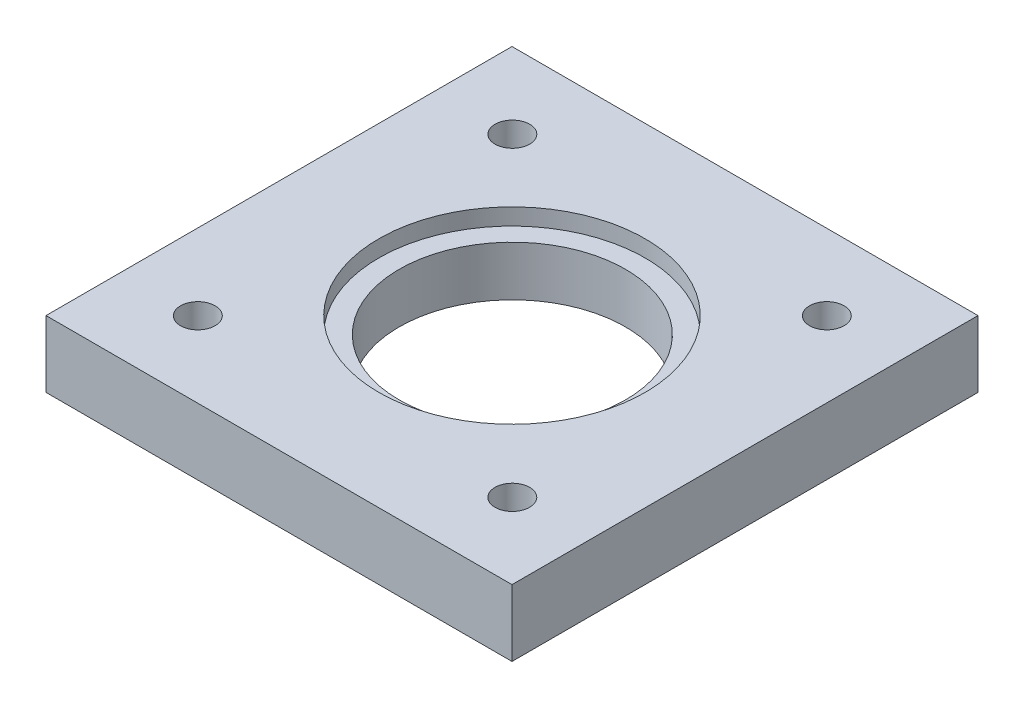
ISO-10303-21;
HEADER;
FILE_DESCRIPTION(('STEP AP214'),'2;1');
FILE_NAME('part.step','',(''),(''),'','','');
FILE_SCHEMA(('AUTOMOTIVE_DESIGN { 1 0 10303 214 1 1 1 1 }'));
ENDSEC;
DATA;
#1=APPLICATION_CONTEXT('core data for automotive mechanical design processes');
#2=APPLICATION_PROTOCOL_DEFINITION('international standard','automotive_design',2000,#1);
#3=PRODUCT_CONTEXT('',#1,'mechanical');
#4=PRODUCT('Part','Part','',(#3));
#5=PRODUCT_RELATED_PRODUCT_CATEGORY('part','',(#4));
#6=PRODUCT_DEFINITION_FORMATION('','',#4);
#7=PRODUCT_DEFINITION_CONTEXT('part definition',#1,'design');
#8=PRODUCT_DEFINITION('design','',#6,#7);
#9=PRODUCT_DEFINITION_SHAPE('','',#8);
#10=(LENGTH_UNIT() NAMED_UNIT(*) SI_UNIT(.MILLI.,.METRE.));
#11=(NAMED_UNIT(*) PLANE_ANGLE_UNIT() SI_UNIT($,.RADIAN.));
#12=(NAMED_UNIT(*) SI_UNIT($,.STERADIAN.) SOLID_ANGLE_UNIT());
#13=UNCERTAINTY_MEASURE_WITH_UNIT(LENGTH_MEASURE(1.E-05),#10,'distance_accuracy_value','');
#14=(GEOMETRIC_REPRESENTATION_CONTEXT(3) GLOBAL_UNCERTAINTY_ASSIGNED_CONTEXT((#13)) GLOBAL_UNIT_ASSIGNED_CONTEXT((#10,
#11,#12)) REPRESENTATION_CONTEXT('',''));
#15=CARTESIAN_POINT('',(0.,0.,0.));
#16=DIRECTION('',(0.,0.,1.));
#17=DIRECTION('',(1.,0.,0.));
#18=AXIS2_PLACEMENT_3D('',#15,#16,#17);
#19=CARTESIAN_POINT('',(-38.3070866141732,10.,-32.6574803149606));
#20=DIRECTION('',(1.,0.,0.));
#21=DIRECTION('',(0.,0.,-1.));
#22=AXIS2_PLACEMENT_3D('',#19,#20,#21);
#23=PLANE('',#22);
#24=DIRECTION('',(0.,0.,1.));
#25=VECTOR('',#24,1.);
#26=CARTESIAN_POINT('',(-38.3070866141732,0.,-32.6574803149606));
#27=LINE('',#26,#25);
#28=CARTESIAN_POINT('',(-38.3070866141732,0.,-32.6574803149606));
#29=VERTEX_POINT('',#28);
#30=CARTESIAN_POINT('',(-38.3070866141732,0.,37.3425196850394));
#31=VERTEX_POINT('',#30);
#32=EDGE_CURVE('E108',#29,#31,#27,.T.);
#33=ORIENTED_EDGE('',*,*,#32,.T.);
#34=DIRECTION('',(0.,-1.,0.));
#35=VECTOR('',#34,1.);
#36=CARTESIAN_POINT('',(-38.3070866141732,10.,37.3425196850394));
#37=LINE('',#36,#35);
#38=CARTESIAN_POINT('',(-38.3070866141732,10.,37.3425196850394));
#39=VERTEX_POINT('',#38);
#40=EDGE_CURVE('E11',#39,#31,#37,.T.);
#41=ORIENTED_EDGE('',*,*,#40,.F.);
#42=DIRECTION('',(0.,0.,1.));
#43=VECTOR('',#42,1.);
#44=CARTESIAN_POINT('',(-38.3070866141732,10.,-32.6574803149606));
#45=LINE('',#44,#43);
#46=CARTESIAN_POINT('',(-38.3070866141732,10.,-32.6574803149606));
#47=VERTEX_POINT('',#46);
#48=EDGE_CURVE('E96',#47,#39,#45,.T.);
#49=ORIENTED_EDGE('',*,*,#48,.F.);
#50=DIRECTION('',(0.,-1.,0.));
#51=VECTOR('',#50,1.);
#52=CARTESIAN_POINT('',(-38.3070866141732,10.,-32.6574803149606));
#53=LINE('',#52,#51);
#54=EDGE_CURVE('E104',#47,#29,#53,.T.);
#55=ORIENTED_EDGE('',*,*,#54,.T.);
#56=EDGE_LOOP('',(#33,#41,#49,#55));
#57=FACE_BOUND('',#56,.T.);
#58=ADVANCED_FACE('F45',(#57),#23,.F.);
#59=CARTESIAN_POINT('',(-38.3070866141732,10.,37.3425196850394));
#60=DIRECTION('',(0.,0.,-1.));
#61=DIRECTION('',(-1.,0.,0.));
#62=AXIS2_PLACEMENT_3D('',#59,#60,#61);
#63=PLANE('',#62);
#64=DIRECTION('',(1.,0.,0.));
#65=VECTOR('',#64,1.);
#66=CARTESIAN_POINT('',(-38.3070866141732,0.,37.3425196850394));
#67=LINE('',#66,#65);
#68=CARTESIAN_POINT('',(31.6929133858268,0.,37.3425196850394));
#69=VERTEX_POINT('',#68);
#70=EDGE_CURVE('E100',#31,#69,#67,.T.);
#71=ORIENTED_EDGE('',*,*,#70,.T.);
#72=DIRECTION('',(0.,-1.,0.));
#73=VECTOR('',#72,1.);
#74=CARTESIAN_POINT('',(31.6929133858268,10.,37.3425196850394));
#75=LINE('',#74,#73);
#76=CARTESIAN_POINT('',(31.6929133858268,10.,37.3425196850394));
#77=VERTEX_POINT('',#76);
#78=EDGE_CURVE('E53',#77,#69,#75,.T.);
#79=ORIENTED_EDGE('',*,*,#78,.F.);
#80=DIRECTION('',(1.,0.,0.));
#81=VECTOR('',#80,1.);
#82=CARTESIAN_POINT('',(-38.3070866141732,10.,37.3425196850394));
#83=LINE('',#82,#81);
#84=EDGE_CURVE('E91',#39,#77,#83,.T.);
#85=ORIENTED_EDGE('',*,*,#84,.F.);
#86=ORIENTED_EDGE('',*,*,#40,.T.);
#87=EDGE_LOOP('',(#71,#79,#85,#86));
#88=FACE_BOUND('',#87,.T.);
#89=ADVANCED_FACE('F99',(#88),#63,.F.);
#90=CARTESIAN_POINT('',(31.6929133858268,10.,-32.6574803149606));
#91=DIRECTION('',(-1.,0.,0.));
#92=DIRECTION('',(0.,0.,1.));
#93=AXIS2_PLACEMENT_3D('',#90,#91,#92);
#94=PLANE('',#93);
#95=DIRECTION('',(0.,0.,-1.));
#96=VECTOR('',#95,1.);
#97=CARTESIAN_POINT('',(31.6929133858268,0.,-32.6574803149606));
#98=LINE('',#97,#96);
#99=CARTESIAN_POINT('',(31.6929133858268,0.,-32.6574803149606));
#100=VERTEX_POINT('',#99);
#101=EDGE_CURVE('E78',#69,#100,#98,.T.);
#102=ORIENTED_EDGE('',*,*,#101,.T.);
#103=DIRECTION('',(0.,-1.,0.));
#104=VECTOR('',#103,1.);
#105=CARTESIAN_POINT('',(31.6929133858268,10.,-32.6574803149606));
#106=LINE('',#105,#104);
#107=CARTESIAN_POINT('',(31.6929133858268,10.,-32.6574803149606));
#108=VERTEX_POINT('',#107);
#109=EDGE_CURVE('E101',#108,#100,#106,.T.);
#110=ORIENTED_EDGE('',*,*,#109,.F.);
#111=DIRECTION('',(0.,0.,-1.));
#112=VECTOR('',#111,1.);
#113=CARTESIAN_POINT('',(31.6929133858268,10.,-32.6574803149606));
#114=LINE('',#113,#112);
#115=EDGE_CURVE('E94',#77,#108,#114,.T.);
#116=ORIENTED_EDGE('',*,*,#115,.F.);
#117=ORIENTED_EDGE('',*,*,#78,.T.);
#118=EDGE_LOOP('',(#102,#110,#116,#117));
#119=FACE_BOUND('',#118,.T.);
#120=ADVANCED_FACE('F102',(#119),#94,.F.);
#121=CARTESIAN_POINT('',(-38.3070866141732,10.,-32.6574803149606));
#122=DIRECTION('',(0.,0.,1.));
#123=DIRECTION('',(1.,0.,0.));
#124=AXIS2_PLACEMENT_3D('',#121,#122,#123);
#125=PLANE('',#124);
#126=DIRECTION('',(-1.,0.,0.));
#127=VECTOR('',#126,1.);
#128=CARTESIAN_POINT('',(-38.3070866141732,0.,-32.6574803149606));
#129=LINE('',#128,#127);
#130=EDGE_CURVE('E84',#100,#29,#129,.T.);
#131=ORIENTED_EDGE('',*,*,#130,.T.);
#132=ORIENTED_EDGE('',*,*,#54,.F.);
#133=DIRECTION('',(-1.,0.,0.));
#134=VECTOR('',#133,1.);
#135=CARTESIAN_POINT('',(-38.3070866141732,10.,-32.6574803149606));
#136=LINE('',#135,#134);
#137=EDGE_CURVE('E61',#108,#47,#136,.T.);
#138=ORIENTED_EDGE('',*,*,#137,.F.);
#139=ORIENTED_EDGE('',*,*,#109,.T.);
#140=EDGE_LOOP('',(#131,#132,#138,#139));
#141=FACE_BOUND('',#140,.T.);
#142=ADVANCED_FACE('F116',(#141),#125,.F.);
#143=CARTESIAN_POINT('',(0.,10.,0.));
#144=DIRECTION('',(0.,1.,0.));
#145=DIRECTION('',(0.,0.,1.));
#146=AXIS2_PLACEMENT_3D('',#143,#144,#145);
#147=PLANE('',#146);
#148=CARTESIAN_POINT('',(-3.30708651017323,10.,2.34251968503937));
#149=DIRECTION('',(0.,1.,0.));
#150=DIRECTION('',(0.,0.,1.));
#151=AXIS2_PLACEMENT_3D('',#148,#149,#150);
#152=CIRCLE('',#151,20.);
#153=CARTESIAN_POINT('',(-3.30708651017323,10.,22.3425196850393));
#154=VERTEX_POINT('',#153);
#155=EDGE_CURVE('E146',#154,#154,#152,.T.);
#156=ORIENTED_EDGE('',*,*,#155,.F.);
#157=EDGE_LOOP('',(#156));
#158=FACE_BOUND('',#157,.T.);
#159=CARTESIAN_POINT('',(-26.8770866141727,10.,25.9645196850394));
#160=DIRECTION('',(0.,1.,0.));
#161=DIRECTION('',(0.,0.,1.));
#162=AXIS2_PLACEMENT_3D('',#159,#160,#161);
#163=CIRCLE('',#162,2.60000000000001);
#164=CARTESIAN_POINT('',(-26.8770866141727,10.,28.5645196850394));
#165=VERTEX_POINT('',#164);
#166=EDGE_CURVE('E131',#165,#165,#163,.T.);
#167=ORIENTED_EDGE('',*,*,#166,.F.);
#168=EDGE_LOOP('',(#167));
#169=FACE_BOUND('',#168,.T.);
#170=CARTESIAN_POINT('',(20.3629133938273,10.,25.9645196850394));
#171=DIRECTION('',(0.,1.,0.));
#172=DIRECTION('',(0.,0.,1.));
#173=AXIS2_PLACEMENT_3D('',#170,#171,#172);
#174=CIRCLE('',#173,2.60000000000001);
#175=CARTESIAN_POINT('',(20.3629133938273,10.,28.5645196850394));
#176=VERTEX_POINT('',#175);
#177=EDGE_CURVE('E138',#176,#176,#174,.T.);
#178=ORIENTED_EDGE('',*,*,#177,.F.);
#179=EDGE_LOOP('',(#178));
#180=FACE_BOUND('',#179,.T.);
#181=CARTESIAN_POINT('',(20.3629133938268,10.,-21.2794803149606));
#182=DIRECTION('',(0.,1.,0.));
#183=DIRECTION('',(0.,0.,1.));
#184=AXIS2_PLACEMENT_3D('',#181,#182,#183);
#185=CIRCLE('',#184,2.60000000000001);
#186=CARTESIAN_POINT('',(20.3629133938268,10.,-18.6794803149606));
#187=VERTEX_POINT('',#186);
#188=EDGE_CURVE('E125',#187,#187,#185,.T.);
#189=ORIENTED_EDGE('',*,*,#188,.F.);
#190=EDGE_LOOP('',(#189));
#191=FACE_BOUND('',#190,.T.);
#192=CARTESIAN_POINT('',(-26.8770866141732,10.,-21.2794803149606));
#193=DIRECTION('',(0.,1.,0.));
#194=DIRECTION('',(0.,0.,1.));
#195=AXIS2_PLACEMENT_3D('',#192,#193,#194);
#196=CIRCLE('',#195,2.60000000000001);
#197=CARTESIAN_POINT('',(-26.8770866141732,10.,-18.6794803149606));
#198=VERTEX_POINT('',#197);
#199=EDGE_CURVE('E122',#198,#198,#196,.T.);
#200=ORIENTED_EDGE('',*,*,#199,.F.);
#201=EDGE_LOOP('',(#200));
#202=FACE_BOUND('',#201,.T.);
#203=ORIENTED_EDGE('',*,*,#48,.T.);
#204=ORIENTED_EDGE('',*,*,#84,.T.);
#205=ORIENTED_EDGE('',*,*,#115,.T.);
#206=ORIENTED_EDGE('',*,*,#137,.T.);
#207=EDGE_LOOP('',(#203,#204,#205,#206));
#208=FACE_BOUND('',#207,.T.);
#209=ADVANCED_FACE('F92',(#158,#169,#180,#191,#202,#208),#147,.T.);
#210=CARTESIAN_POINT('',(0.,0.,0.));
#211=DIRECTION('',(0.,1.,0.));
#212=DIRECTION('',(0.,0.,1.));
#213=AXIS2_PLACEMENT_3D('',#210,#211,#212);
#214=PLANE('',#213);
#215=CARTESIAN_POINT('',(-3.30708661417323,0.,2.29051968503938));
#216=DIRECTION('',(0.,1.,0.));
#217=DIRECTION('',(0.,0.,1.));
#218=AXIS2_PLACEMENT_3D('',#215,#216,#217);
#219=CIRCLE('',#218,17.);
#220=CARTESIAN_POINT('',(-3.30708661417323,0.,19.2905196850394));
#221=VERTEX_POINT('',#220);
#222=EDGE_CURVE('E149',#221,#221,#219,.T.);
#223=ORIENTED_EDGE('',*,*,#222,.T.);
#224=EDGE_LOOP('',(#223));
#225=FACE_BOUND('',#224,.T.);
#226=CARTESIAN_POINT('',(-26.8770866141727,0.,25.9645196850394));
#227=DIRECTION('',(0.,1.,0.));
#228=DIRECTION('',(0.,0.,1.));
#229=AXIS2_PLACEMENT_3D('',#226,#227,#228);
#230=CIRCLE('',#229,2.60000000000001);
#231=CARTESIAN_POINT('',(-26.8770866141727,0.,28.5645196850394));
#232=VERTEX_POINT('',#231);
#233=EDGE_CURVE('E128',#232,#232,#230,.T.);
#234=ORIENTED_EDGE('',*,*,#233,.T.);
#235=EDGE_LOOP('',(#234));
#236=FACE_BOUND('',#235,.T.);
#237=CARTESIAN_POINT('',(20.3629133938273,0.,25.9645196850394));
#238=DIRECTION('',(0.,1.,0.));
#239=DIRECTION('',(0.,0.,1.));
#240=AXIS2_PLACEMENT_3D('',#237,#238,#239);
#241=CIRCLE('',#240,2.60000000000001);
#242=CARTESIAN_POINT('',(20.3629133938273,0.,28.5645196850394));
#243=VERTEX_POINT('',#242);
#244=EDGE_CURVE('E135',#243,#243,#241,.T.);
#245=ORIENTED_EDGE('',*,*,#244,.T.);
#246=EDGE_LOOP('',(#245));
#247=FACE_BOUND('',#246,.T.);
#248=CARTESIAN_POINT('',(20.3629133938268,0.,-21.2794803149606));
#249=DIRECTION('',(0.,1.,0.));
#250=DIRECTION('',(0.,0.,1.));
#251=AXIS2_PLACEMENT_3D('',#248,#249,#250);
#252=CIRCLE('',#251,2.60000000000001);
#253=CARTESIAN_POINT('',(20.3629133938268,0.,-18.6794803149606));
#254=VERTEX_POINT('',#253);
#255=EDGE_CURVE('E141',#254,#254,#252,.T.);
#256=ORIENTED_EDGE('',*,*,#255,.T.);
#257=EDGE_LOOP('',(#256));
#258=FACE_BOUND('',#257,.T.);
#259=CARTESIAN_POINT('',(-26.8770866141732,0.,-21.2794803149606));
#260=DIRECTION('',(0.,1.,0.));
#261=DIRECTION('',(0.,0.,1.));
#262=AXIS2_PLACEMENT_3D('',#259,#260,#261);
#263=CIRCLE('',#262,2.60000000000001);
#264=CARTESIAN_POINT('',(-26.8770866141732,0.,-18.6794803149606));
#265=VERTEX_POINT('',#264);
#266=EDGE_CURVE('E111',#265,#265,#263,.T.);
#267=ORIENTED_EDGE('',*,*,#266,.T.);
#268=EDGE_LOOP('',(#267));
#269=FACE_BOUND('',#268,.T.);
#270=ORIENTED_EDGE('',*,*,#32,.F.);
#271=ORIENTED_EDGE('',*,*,#130,.F.);
#272=ORIENTED_EDGE('',*,*,#101,.F.);
#273=ORIENTED_EDGE('',*,*,#70,.F.);
#274=EDGE_LOOP('',(#270,#271,#272,#273));
#275=FACE_BOUND('',#274,.T.);
#276=ADVANCED_FACE('F119',(#225,#236,#247,#258,#269,#275),#214,.F.);
#277=CARTESIAN_POINT('',(-26.8770866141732,0.,-21.2794803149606));
#278=DIRECTION('',(0.,1.,0.));
#279=DIRECTION('',(0.,0.,1.));
#280=AXIS2_PLACEMENT_3D('',#277,#278,#279);
#281=CYLINDRICAL_SURFACE('',#280,2.60000000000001);
#282=ORIENTED_EDGE('',*,*,#266,.F.);
#283=EDGE_LOOP('',(#282));
#284=FACE_BOUND('',#283,.T.);
#285=ORIENTED_EDGE('',*,*,#199,.T.);
#286=EDGE_LOOP('',(#285));
#287=FACE_BOUND('',#286,.T.);
#288=ADVANCED_FACE('F190',(#284,#287),#281,.F.);
#289=CARTESIAN_POINT('',(20.3629133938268,0.,-21.2794803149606));
#290=DIRECTION('',(0.,1.,0.));
#291=DIRECTION('',(0.,0.,1.));
#292=AXIS2_PLACEMENT_3D('',#289,#290,#291);
#293=CYLINDRICAL_SURFACE('',#292,2.60000000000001);
#294=ORIENTED_EDGE('',*,*,#255,.F.);
#295=EDGE_LOOP('',(#294));
#296=FACE_BOUND('',#295,.T.);
#297=ORIENTED_EDGE('',*,*,#188,.T.);
#298=EDGE_LOOP('',(#297));
#299=FACE_BOUND('',#298,.T.);
#300=ADVANCED_FACE('F192',(#296,#299),#293,.F.);
#301=CARTESIAN_POINT('',(20.3629133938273,0.,25.9645196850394));
#302=DIRECTION('',(0.,1.,0.));
#303=DIRECTION('',(0.,0.,1.));
#304=AXIS2_PLACEMENT_3D('',#301,#302,#303);
#305=CYLINDRICAL_SURFACE('',#304,2.60000000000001);
#306=ORIENTED_EDGE('',*,*,#244,.F.);
#307=EDGE_LOOP('',(#306));
#308=FACE_BOUND('',#307,.T.);
#309=ORIENTED_EDGE('',*,*,#177,.T.);
#310=EDGE_LOOP('',(#309));
#311=FACE_BOUND('',#310,.T.);
#312=ADVANCED_FACE('F199',(#308,#311),#305,.F.);
#313=CARTESIAN_POINT('',(-26.8770866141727,0.,25.9645196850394));
#314=DIRECTION('',(0.,1.,0.));
#315=DIRECTION('',(0.,0.,1.));
#316=AXIS2_PLACEMENT_3D('',#313,#314,#315);
#317=CYLINDRICAL_SURFACE('',#316,2.60000000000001);
#318=ORIENTED_EDGE('',*,*,#233,.F.);
#319=EDGE_LOOP('',(#318));
#320=FACE_BOUND('',#319,.T.);
#321=ORIENTED_EDGE('',*,*,#166,.T.);
#322=EDGE_LOOP('',(#321));
#323=FACE_BOUND('',#322,.T.);
#324=ADVANCED_FACE('F175',(#320,#323),#317,.F.);
#325=CARTESIAN_POINT('',(-3.30708651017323,7.5,2.34251968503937));
#326=DIRECTION('',(0.,1.,0.));
#327=DIRECTION('',(0.,0.,1.));
#328=AXIS2_PLACEMENT_3D('',#325,#326,#327);
#329=CYLINDRICAL_SURFACE('',#328,20.);
#330=CARTESIAN_POINT('',(-3.30708651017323,7.5,2.34251968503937));
#331=DIRECTION('',(0.,1.,0.));
#332=DIRECTION('',(0.,0.,1.));
#333=AXIS2_PLACEMENT_3D('',#330,#331,#332);
#334=CIRCLE('',#333,20.);
#335=CARTESIAN_POINT('',(-3.30708651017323,7.5,22.3425196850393));
#336=VERTEX_POINT('',#335);
#337=EDGE_CURVE('E132',#336,#336,#334,.T.);
#338=ORIENTED_EDGE('',*,*,#337,.F.);
#339=EDGE_LOOP('',(#338));
#340=FACE_BOUND('',#339,.T.);
#341=ORIENTED_EDGE('',*,*,#155,.T.);
#342=EDGE_LOOP('',(#341));
#343=FACE_BOUND('',#342,.T.);
#344=ADVANCED_FACE('F169',(#340,#343),#329,.F.);
#345=CARTESIAN_POINT('',(-3.30708651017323,7.5,2.34251968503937));
#346=DIRECTION('',(0.,1.,0.));
#347=DIRECTION('',(0.,0.,1.));
#348=AXIS2_PLACEMENT_3D('',#345,#346,#347);
#349=PLANE('',#348);
#350=CARTESIAN_POINT('',(-3.30708661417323,7.5,2.29051968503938));
#351=DIRECTION('',(0.,1.,0.));
#352=DIRECTION('',(0.,0.,1.));
#353=AXIS2_PLACEMENT_3D('',#350,#351,#352);
#354=CIRCLE('',#353,17.);
#355=CARTESIAN_POINT('',(-3.30708661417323,7.5,19.2905196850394));
#356=VERTEX_POINT('',#355);
#357=EDGE_CURVE('E152',#356,#356,#354,.T.);
#358=ORIENTED_EDGE('',*,*,#357,.F.);
#359=EDGE_LOOP('',(#358));
#360=FACE_BOUND('',#359,.T.);
#361=ORIENTED_EDGE('',*,*,#337,.T.);
#362=EDGE_LOOP('',(#361));
#363=FACE_BOUND('',#362,.T.);
#364=ADVANCED_FACE('F163',(#360,#363),#349,.T.);
#365=CARTESIAN_POINT('',(-3.30708661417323,0.,2.29051968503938));
#366=DIRECTION('',(0.,1.,0.));
#367=DIRECTION('',(0.,0.,1.));
#368=AXIS2_PLACEMENT_3D('',#365,#366,#367);
#369=CYLINDRICAL_SURFACE('',#368,17.);
#370=ORIENTED_EDGE('',*,*,#222,.F.);
#371=EDGE_LOOP('',(#370));
#372=FACE_BOUND('',#371,.T.);
#373=ORIENTED_EDGE('',*,*,#357,.T.);
#374=EDGE_LOOP('',(#373));
#375=FACE_BOUND('',#374,.T.);
#376=ADVANCED_FACE('F160',(#372,#375),#369,.F.);
#377=CLOSED_SHELL('',(#58,#89,#120,#142,#209,#276,#288,#300,#312,#324,#344,#364,#376));
#378=MANIFOLD_SOLID_BREP('B2',#377);
#379=ADVANCED_BREP_SHAPE_REPRESENTATION('',(#18,#378),#14);
#380=SHAPE_DEFINITION_REPRESENTATION(#9,#379);
ENDSEC;
END-ISO-10303-21;
